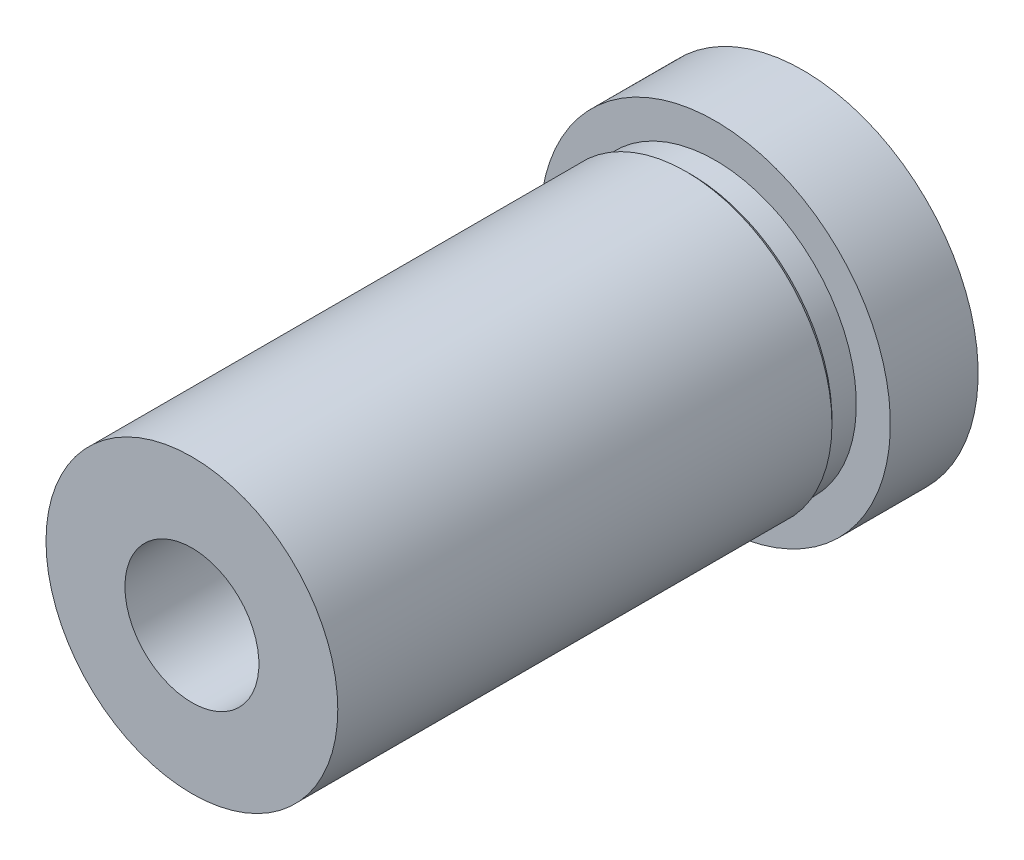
ISO-10303-21;
HEADER;
FILE_DESCRIPTION(('STEP AP214'),'2;1');
FILE_NAME('part.step','',(''),(''),'','','');
FILE_SCHEMA(('AUTOMOTIVE_DESIGN { 1 0 10303 214 1 1 1 1 }'));
ENDSEC;
DATA;
#1=APPLICATION_CONTEXT('core data for automotive mechanical design processes');
#2=APPLICATION_PROTOCOL_DEFINITION('international standard','automotive_design',2000,#1);
#3=PRODUCT_CONTEXT('',#1,'mechanical');
#4=PRODUCT('Part','Part','',(#3));
#5=PRODUCT_RELATED_PRODUCT_CATEGORY('part','',(#4));
#6=PRODUCT_DEFINITION_FORMATION('','',#4);
#7=PRODUCT_DEFINITION_CONTEXT('part definition',#1,'design');
#8=PRODUCT_DEFINITION('design','',#6,#7);
#9=PRODUCT_DEFINITION_SHAPE('','',#8);
#10=(LENGTH_UNIT() NAMED_UNIT(*) SI_UNIT(.MILLI.,.METRE.));
#11=(NAMED_UNIT(*) PLANE_ANGLE_UNIT() SI_UNIT($,.RADIAN.));
#12=(NAMED_UNIT(*) SI_UNIT($,.STERADIAN.) SOLID_ANGLE_UNIT());
#13=UNCERTAINTY_MEASURE_WITH_UNIT(LENGTH_MEASURE(1.E-05),#10,'distance_accuracy_value','');
#14=(GEOMETRIC_REPRESENTATION_CONTEXT(3) GLOBAL_UNCERTAINTY_ASSIGNED_CONTEXT((#13)) GLOBAL_UNIT_ASSIGNED_CONTEXT((#10,
#11,#12)) REPRESENTATION_CONTEXT('',''));
#15=CARTESIAN_POINT('',(0.,0.,0.));
#16=DIRECTION('',(0.,0.,1.));
#17=DIRECTION('',(1.,0.,0.));
#18=AXIS2_PLACEMENT_3D('',#15,#16,#17);
#19=CARTESIAN_POINT('',(-9.52500000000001,0.,-4.7752));
#20=DIRECTION('',(0.,0.,1.));
#21=DIRECTION('',(1.,0.,0.));
#22=AXIS2_PLACEMENT_3D('',#19,#20,#21);
#23=PLANE('',#22);
#24=CARTESIAN_POINT('',(0.,0.,-4.7752));
#25=DIRECTION('',(0.,0.,-1.));
#26=DIRECTION('',(-1.,0.,0.));
#27=AXIS2_PLACEMENT_3D('',#24,#25,#26);
#28=CIRCLE('',#27,9.525);
#29=CARTESIAN_POINT('',(-9.525,0.,-4.7752));
#30=VERTEX_POINT('',#29);
#31=EDGE_CURVE('E51',#30,#30,#28,.T.);
#32=ORIENTED_EDGE('',*,*,#31,.T.);
#33=EDGE_LOOP('',(#32));
#34=FACE_BOUND('',#33,.T.);
#35=CARTESIAN_POINT('',(0.,0.,-4.7752));
#36=DIRECTION('',(0.,0.,1.));
#37=DIRECTION('',(1.,0.,0.));
#38=AXIS2_PLACEMENT_3D('',#35,#36,#37);
#39=CIRCLE('',#38,3.64490000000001);
#40=CARTESIAN_POINT('',(3.64490000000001,0.,-4.7752));
#41=VERTEX_POINT('',#40);
#42=EDGE_CURVE('E10',#41,#41,#39,.T.);
#43=ORIENTED_EDGE('',*,*,#42,.T.);
#44=EDGE_LOOP('',(#43));
#45=FACE_BOUND('',#44,.T.);
#46=ADVANCED_FACE('F43',(#34,#45),#23,.F.);
#47=CARTESIAN_POINT('',(0.,0.,-19.4322936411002));
#48=DIRECTION('',(0.,0.,-1.));
#49=DIRECTION('',(-1.,0.,0.));
#50=AXIS2_PLACEMENT_3D('',#47,#48,#49);
#51=CYLINDRICAL_SURFACE('',#50,9.525);
#52=ORIENTED_EDGE('',*,*,#31,.F.);
#53=EDGE_LOOP('',(#52));
#54=FACE_BOUND('',#53,.T.);
#55=CARTESIAN_POINT('',(0.,0.,0.));
#56=DIRECTION('',(0.,0.,-1.));
#57=DIRECTION('',(-1.,0.,0.));
#58=AXIS2_PLACEMENT_3D('',#55,#56,#57);
#59=CIRCLE('',#58,9.525);
#60=CARTESIAN_POINT('',(-9.525,0.,0.));
#61=VERTEX_POINT('',#60);
#62=EDGE_CURVE('E57',#61,#61,#59,.T.);
#63=ORIENTED_EDGE('',*,*,#62,.T.);
#64=EDGE_LOOP('',(#63));
#65=FACE_BOUND('',#64,.T.);
#66=ADVANCED_FACE('F98',(#54,#65),#51,.T.);
#67=CARTESIAN_POINT('',(-7.6729166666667,0.,0.));
#68=DIRECTION('',(0.,0.,-1.));
#69=DIRECTION('',(-1.,0.,0.));
#70=AXIS2_PLACEMENT_3D('',#67,#68,#69);
#71=PLANE('',#70);
#72=ORIENTED_EDGE('',*,*,#62,.F.);
#73=EDGE_LOOP('',(#72));
#74=FACE_BOUND('',#73,.T.);
#75=CARTESIAN_POINT('',(0.,0.,0.));
#76=DIRECTION('',(0.,0.,-1.));
#77=DIRECTION('',(-1.,0.,0.));
#78=AXIS2_PLACEMENT_3D('',#75,#76,#77);
#79=CIRCLE('',#78,7.67291666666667);
#80=CARTESIAN_POINT('',(-7.67291666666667,0.,0.));
#81=VERTEX_POINT('',#80);
#82=EDGE_CURVE('E63',#81,#81,#79,.T.);
#83=ORIENTED_EDGE('',*,*,#82,.T.);
#84=EDGE_LOOP('',(#83));
#85=FACE_BOUND('',#84,.T.);
#86=ADVANCED_FACE('F102',(#74,#85),#71,.F.);
#87=CARTESIAN_POINT('',(0.,0.,-19.4322936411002));
#88=DIRECTION('',(0.,0.,-1.));
#89=DIRECTION('',(-1.,0.,0.));
#90=AXIS2_PLACEMENT_3D('',#87,#88,#89);
#91=CYLINDRICAL_SURFACE('',#90,7.67291666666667);
#92=ORIENTED_EDGE('',*,*,#82,.F.);
#93=EDGE_LOOP('',(#92));
#94=FACE_BOUND('',#93,.T.);
#95=CARTESIAN_POINT('',(0.,0.,1.32715));
#96=DIRECTION('',(0.,0.,-1.));
#97=DIRECTION('',(-1.,0.,0.));
#98=AXIS2_PLACEMENT_3D('',#95,#96,#97);
#99=CIRCLE('',#98,7.67291666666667);
#100=CARTESIAN_POINT('',(-7.67291666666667,0.,1.32715));
#101=VERTEX_POINT('',#100);
#102=EDGE_CURVE('E69',#101,#101,#99,.T.);
#103=ORIENTED_EDGE('',*,*,#102,.T.);
#104=EDGE_LOOP('',(#103));
#105=FACE_BOUND('',#104,.T.);
#106=ADVANCED_FACE('F108',(#94,#105),#91,.T.);
#107=CARTESIAN_POINT('',(0.,0.,1.59173333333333));
#108=DIRECTION('',(0.,0.,1.));
#109=DIRECTION('',(1.,0.,0.));
#110=AXIS2_PLACEMENT_3D('',#107,#108,#109);
#111=CONICAL_SURFACE('',#110,7.9375,0.785398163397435);
#112=ORIENTED_EDGE('',*,*,#102,.F.);
#113=EDGE_LOOP('',(#112));
#114=FACE_BOUND('',#113,.T.);
#115=CARTESIAN_POINT('',(0.,0.,1.59173333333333));
#116=DIRECTION('',(0.,0.,-1.));
#117=DIRECTION('',(-1.,0.,0.));
#118=AXIS2_PLACEMENT_3D('',#115,#116,#117);
#119=CIRCLE('',#118,7.9375);
#120=CARTESIAN_POINT('',(-7.9375,0.,1.59173333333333));
#121=VERTEX_POINT('',#120);
#122=EDGE_CURVE('E73',#121,#121,#119,.T.);
#123=ORIENTED_EDGE('',*,*,#122,.T.);
#124=EDGE_LOOP('',(#123));
#125=FACE_BOUND('',#124,.T.);
#126=ADVANCED_FACE('F112',(#114,#125),#111,.T.);
#127=CARTESIAN_POINT('',(0.,0.,-19.4322936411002));
#128=DIRECTION('',(0.,0.,-1.));
#129=DIRECTION('',(-1.,0.,0.));
#130=AXIS2_PLACEMENT_3D('',#127,#128,#129);
#131=CYLINDRICAL_SURFACE('',#130,7.9375);
#132=ORIENTED_EDGE('',*,*,#122,.F.);
#133=EDGE_LOOP('',(#132));
#134=FACE_BOUND('',#133,.T.);
#135=CARTESIAN_POINT('',(0.,0.,28.47467));
#136=DIRECTION('',(0.,0.,-1.));
#137=DIRECTION('',(-1.,0.,0.));
#138=AXIS2_PLACEMENT_3D('',#135,#136,#137);
#139=CIRCLE('',#138,7.93750000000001);
#140=CARTESIAN_POINT('',(-7.93750000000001,0.,28.47467));
#141=VERTEX_POINT('',#140);
#142=EDGE_CURVE('E77',#141,#141,#139,.T.);
#143=ORIENTED_EDGE('',*,*,#142,.T.);
#144=EDGE_LOOP('',(#143));
#145=FACE_BOUND('',#144,.T.);
#146=ADVANCED_FACE('F94',(#134,#145),#131,.T.);
#147=CARTESIAN_POINT('',(-3.64490000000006,0.,28.47467));
#148=DIRECTION('',(0.,0.,-1.));
#149=DIRECTION('',(-1.,0.,0.));
#150=AXIS2_PLACEMENT_3D('',#147,#148,#149);
#151=PLANE('',#150);
#152=ORIENTED_EDGE('',*,*,#142,.F.);
#153=EDGE_LOOP('',(#152));
#154=FACE_BOUND('',#153,.T.);
#155=CARTESIAN_POINT('',(0.,0.,28.47467));
#156=DIRECTION('',(0.,0.,-1.));
#157=DIRECTION('',(-1.,0.,0.));
#158=AXIS2_PLACEMENT_3D('',#155,#156,#157);
#159=CIRCLE('',#158,3.64490000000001);
#160=CARTESIAN_POINT('',(-3.64490000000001,0.,28.47467));
#161=VERTEX_POINT('',#160);
#162=EDGE_CURVE('E81',#161,#161,#159,.T.);
#163=ORIENTED_EDGE('',*,*,#162,.T.);
#164=EDGE_LOOP('',(#163));
#165=FACE_BOUND('',#164,.T.);
#166=ADVANCED_FACE('F87',(#154,#165),#151,.F.);
#167=CARTESIAN_POINT('',(0.,0.,-19.4322936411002));
#168=DIRECTION('',(0.,0.,-1.));
#169=DIRECTION('',(-1.,0.,0.));
#170=AXIS2_PLACEMENT_3D('',#167,#168,#169);
#171=CYLINDRICAL_SURFACE('',#170,3.64490000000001);
#172=ORIENTED_EDGE('',*,*,#162,.F.);
#173=EDGE_LOOP('',(#172));
#174=FACE_BOUND('',#173,.T.);
#175=ORIENTED_EDGE('',*,*,#42,.F.);
#176=EDGE_LOOP('',(#175));
#177=FACE_BOUND('',#176,.T.);
#178=ADVANCED_FACE('F45',(#174,#177),#171,.F.);
#179=CLOSED_SHELL('',(#46,#66,#86,#106,#126,#146,#166,#178));
#180=MANIFOLD_SOLID_BREP('B2',#179);
#181=ADVANCED_BREP_SHAPE_REPRESENTATION('',(#18,#180),#14);
#182=SHAPE_DEFINITION_REPRESENTATION(#9,#181);
ENDSEC;
END-ISO-10303-21;
